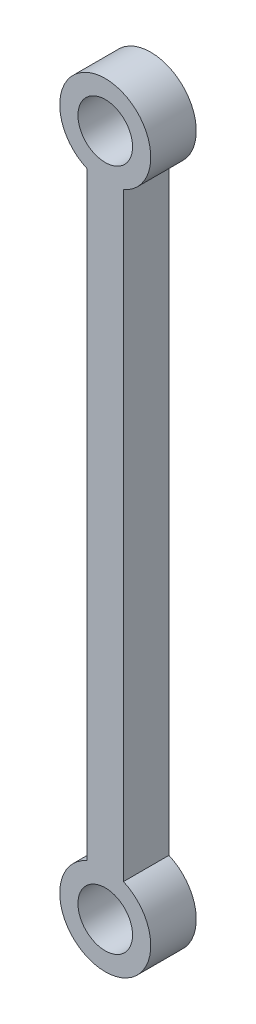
ISO-10303-21;
HEADER;
FILE_DESCRIPTION(('STEP AP214'),'2;1');
FILE_NAME('part.step','',(''),(''),'','','');
FILE_SCHEMA(('AUTOMOTIVE_DESIGN { 1 0 10303 214 1 1 1 1 }'));
ENDSEC;
DATA;
#1=APPLICATION_CONTEXT('core data for automotive mechanical design processes');
#2=APPLICATION_PROTOCOL_DEFINITION('international standard','automotive_design',2000,#1);
#3=PRODUCT_CONTEXT('',#1,'mechanical');
#4=PRODUCT('Part','Part','',(#3));
#5=PRODUCT_RELATED_PRODUCT_CATEGORY('part','',(#4));
#6=PRODUCT_DEFINITION_FORMATION('','',#4);
#7=PRODUCT_DEFINITION_CONTEXT('part definition',#1,'design');
#8=PRODUCT_DEFINITION('design','',#6,#7);
#9=PRODUCT_DEFINITION_SHAPE('','',#8);
#10=(LENGTH_UNIT() NAMED_UNIT(*) SI_UNIT(.MILLI.,.METRE.));
#11=(NAMED_UNIT(*) PLANE_ANGLE_UNIT() SI_UNIT($,.RADIAN.));
#12=(NAMED_UNIT(*) SI_UNIT($,.STERADIAN.) SOLID_ANGLE_UNIT());
#13=UNCERTAINTY_MEASURE_WITH_UNIT(LENGTH_MEASURE(1.E-05),#10,'distance_accuracy_value','');
#14=(GEOMETRIC_REPRESENTATION_CONTEXT(3) GLOBAL_UNCERTAINTY_ASSIGNED_CONTEXT((#13)) GLOBAL_UNIT_ASSIGNED_CONTEXT((#10,
#11,#12)) REPRESENTATION_CONTEXT('',''));
#15=CARTESIAN_POINT('',(0.,0.,0.));
#16=DIRECTION('',(0.,0.,1.));
#17=DIRECTION('',(1.,0.,0.));
#18=AXIS2_PLACEMENT_3D('',#15,#16,#17);
#19=CARTESIAN_POINT('',(0.,-75.,5.));
#20=DIRECTION('',(0.,0.,1.));
#21=DIRECTION('',(1.,0.,0.));
#22=AXIS2_PLACEMENT_3D('',#19,#20,#21);
#23=PLANE('',#22);
#24=CARTESIAN_POINT('',(0.,0.,5.));
#25=DIRECTION('',(0.,0.,1.));
#26=DIRECTION('',(1.,0.,0.));
#27=AXIS2_PLACEMENT_3D('',#24,#25,#26);
#28=CIRCLE('',#27,3.);
#29=CARTESIAN_POINT('',(3.,0.,5.));
#30=VERTEX_POINT('',#29);
#31=EDGE_CURVE('E99',#30,#30,#28,.T.);
#32=ORIENTED_EDGE('',*,*,#31,.F.);
#33=EDGE_LOOP('',(#32));
#34=FACE_BOUND('',#33,.T.);
#35=CARTESIAN_POINT('',(0.,-75.,5.));
#36=DIRECTION('',(0.,0.,1.));
#37=DIRECTION('',(1.,0.,0.));
#38=AXIS2_PLACEMENT_3D('',#35,#36,#37);
#39=CIRCLE('',#38,5.);
#40=CARTESIAN_POINT('',(-1.99999999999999,-70.4174243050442,5.));
#41=VERTEX_POINT('',#40);
#42=CARTESIAN_POINT('',(2.00000000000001,-70.4174243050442,5.));
#43=VERTEX_POINT('',#42);
#44=EDGE_CURVE('E84',#41,#43,#39,.T.);
#45=ORIENTED_EDGE('',*,*,#44,.T.);
#46=DIRECTION('',(0.,1.,0.));
#47=VECTOR('',#46,1.);
#48=CARTESIAN_POINT('',(2.,-4.58257569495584,5.));
#49=LINE('',#48,#47);
#50=CARTESIAN_POINT('',(2.,-4.58257569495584,5.));
#51=VERTEX_POINT('',#50);
#52=EDGE_CURVE('E79',#43,#51,#49,.T.);
#53=ORIENTED_EDGE('',*,*,#52,.T.);
#54=CARTESIAN_POINT('',(0.,0.,5.));
#55=DIRECTION('',(0.,0.,1.));
#56=DIRECTION('',(1.,0.,0.));
#57=AXIS2_PLACEMENT_3D('',#54,#55,#56);
#58=CIRCLE('',#57,5.);
#59=CARTESIAN_POINT('',(-2.,-4.58257569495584,5.));
#60=VERTEX_POINT('',#59);
#61=EDGE_CURVE('E82',#51,#60,#58,.T.);
#62=ORIENTED_EDGE('',*,*,#61,.T.);
#63=DIRECTION('',(0.,-1.,0.));
#64=VECTOR('',#63,1.);
#65=CARTESIAN_POINT('',(-2.,-4.58257569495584,5.));
#66=LINE('',#65,#64);
#67=EDGE_CURVE('E49',#60,#41,#66,.T.);
#68=ORIENTED_EDGE('',*,*,#67,.T.);
#69=EDGE_LOOP('',(#45,#53,#62,#68));
#70=FACE_BOUND('',#69,.T.);
#71=CARTESIAN_POINT('',(0.,-75.,5.));
#72=DIRECTION('',(0.,0.,1.));
#73=DIRECTION('',(1.,0.,0.));
#74=AXIS2_PLACEMENT_3D('',#71,#72,#73);
#75=CIRCLE('',#74,3.);
#76=CARTESIAN_POINT('',(3.00000000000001,-75.,5.));
#77=VERTEX_POINT('',#76);
#78=EDGE_CURVE('E114',#77,#77,#75,.T.);
#79=ORIENTED_EDGE('',*,*,#78,.F.);
#80=EDGE_LOOP('',(#79));
#81=FACE_BOUND('',#80,.T.);
#82=ADVANCED_FACE('F32',(#34,#70,#81),#23,.T.);
#83=CARTESIAN_POINT('',(0.,-75.,0.));
#84=DIRECTION('',(0.,0.,1.));
#85=DIRECTION('',(1.,0.,0.));
#86=AXIS2_PLACEMENT_3D('',#83,#84,#85);
#87=PLANE('',#86);
#88=CARTESIAN_POINT('',(0.,0.,0.));
#89=DIRECTION('',(0.,0.,1.));
#90=DIRECTION('',(1.,0.,0.));
#91=AXIS2_PLACEMENT_3D('',#88,#89,#90);
#92=CIRCLE('',#91,3.);
#93=CARTESIAN_POINT('',(3.,0.,0.));
#94=VERTEX_POINT('',#93);
#95=EDGE_CURVE('E111',#94,#94,#92,.T.);
#96=ORIENTED_EDGE('',*,*,#95,.T.);
#97=EDGE_LOOP('',(#96));
#98=FACE_BOUND('',#97,.T.);
#99=CARTESIAN_POINT('',(0.,-75.,0.));
#100=DIRECTION('',(0.,0.,1.));
#101=DIRECTION('',(1.,0.,0.));
#102=AXIS2_PLACEMENT_3D('',#99,#100,#101);
#103=CIRCLE('',#102,5.);
#104=CARTESIAN_POINT('',(-1.99999999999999,-70.4174243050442,0.));
#105=VERTEX_POINT('',#104);
#106=CARTESIAN_POINT('',(2.00000000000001,-70.4174243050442,0.));
#107=VERTEX_POINT('',#106);
#108=EDGE_CURVE('E96',#105,#107,#103,.T.);
#109=ORIENTED_EDGE('',*,*,#108,.F.);
#110=DIRECTION('',(0.,-1.,0.));
#111=VECTOR('',#110,1.);
#112=CARTESIAN_POINT('',(-2.,-4.58257569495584,0.));
#113=LINE('',#112,#111);
#114=CARTESIAN_POINT('',(-2.,-4.58257569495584,0.));
#115=VERTEX_POINT('',#114);
#116=EDGE_CURVE('E72',#115,#105,#113,.T.);
#117=ORIENTED_EDGE('',*,*,#116,.F.);
#118=CARTESIAN_POINT('',(0.,0.,0.));
#119=DIRECTION('',(0.,0.,1.));
#120=DIRECTION('',(1.,0.,0.));
#121=AXIS2_PLACEMENT_3D('',#118,#119,#120);
#122=CIRCLE('',#121,5.);
#123=CARTESIAN_POINT('',(2.,-4.58257569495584,0.));
#124=VERTEX_POINT('',#123);
#125=EDGE_CURVE('E66',#124,#115,#122,.T.);
#126=ORIENTED_EDGE('',*,*,#125,.F.);
#127=DIRECTION('',(0.,1.,0.));
#128=VECTOR('',#127,1.);
#129=CARTESIAN_POINT('',(2.,-4.58257569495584,0.));
#130=LINE('',#129,#128);
#131=EDGE_CURVE('E88',#107,#124,#130,.T.);
#132=ORIENTED_EDGE('',*,*,#131,.F.);
#133=EDGE_LOOP('',(#109,#117,#126,#132));
#134=FACE_BOUND('',#133,.T.);
#135=CARTESIAN_POINT('',(0.,-75.,0.));
#136=DIRECTION('',(0.,0.,1.));
#137=DIRECTION('',(1.,0.,0.));
#138=AXIS2_PLACEMENT_3D('',#135,#136,#137);
#139=CIRCLE('',#138,3.);
#140=CARTESIAN_POINT('',(3.00000000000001,-75.,0.));
#141=VERTEX_POINT('',#140);
#142=EDGE_CURVE('E117',#141,#141,#139,.T.);
#143=ORIENTED_EDGE('',*,*,#142,.T.);
#144=EDGE_LOOP('',(#143));
#145=FACE_BOUND('',#144,.T.);
#146=ADVANCED_FACE('F107',(#98,#134,#145),#87,.F.);
#147=CARTESIAN_POINT('',(0.,-75.,5.));
#148=DIRECTION('',(0.,0.,-1.));
#149=DIRECTION('',(-1.,0.,0.));
#150=AXIS2_PLACEMENT_3D('',#147,#148,#149);
#151=CYLINDRICAL_SURFACE('',#150,5.);
#152=ORIENTED_EDGE('',*,*,#108,.T.);
#153=DIRECTION('',(0.,0.,-1.));
#154=VECTOR('',#153,1.);
#155=CARTESIAN_POINT('',(2.00000000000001,-70.4174243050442,5.));
#156=LINE('',#155,#154);
#157=EDGE_CURVE('E11',#43,#107,#156,.T.);
#158=ORIENTED_EDGE('',*,*,#157,.F.);
#159=ORIENTED_EDGE('',*,*,#44,.F.);
#160=DIRECTION('',(0.,0.,-1.));
#161=VECTOR('',#160,1.);
#162=CARTESIAN_POINT('',(-1.99999999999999,-70.4174243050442,5.));
#163=LINE('',#162,#161);
#164=EDGE_CURVE('E92',#41,#105,#163,.T.);
#165=ORIENTED_EDGE('',*,*,#164,.T.);
#166=EDGE_LOOP('',(#152,#158,#159,#165));
#167=FACE_BOUND('',#166,.T.);
#168=ADVANCED_FACE('F34',(#167),#151,.T.);
#169=CARTESIAN_POINT('',(2.,-4.58257569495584,5.));
#170=DIRECTION('',(-1.,0.,0.));
#171=DIRECTION('',(0.,-1.,0.));
#172=AXIS2_PLACEMENT_3D('',#169,#170,#171);
#173=PLANE('',#172);
#174=ORIENTED_EDGE('',*,*,#131,.T.);
#175=DIRECTION('',(0.,0.,-1.));
#176=VECTOR('',#175,1.);
#177=CARTESIAN_POINT('',(2.,-4.58257569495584,5.));
#178=LINE('',#177,#176);
#179=EDGE_CURVE('E41',#51,#124,#178,.T.);
#180=ORIENTED_EDGE('',*,*,#179,.F.);
#181=ORIENTED_EDGE('',*,*,#52,.F.);
#182=ORIENTED_EDGE('',*,*,#157,.T.);
#183=EDGE_LOOP('',(#174,#180,#181,#182));
#184=FACE_BOUND('',#183,.T.);
#185=ADVANCED_FACE('F87',(#184),#173,.F.);
#186=CARTESIAN_POINT('',(0.,0.,5.));
#187=DIRECTION('',(0.,0.,-1.));
#188=DIRECTION('',(-1.,0.,0.));
#189=AXIS2_PLACEMENT_3D('',#186,#187,#188);
#190=CYLINDRICAL_SURFACE('',#189,5.);
#191=ORIENTED_EDGE('',*,*,#125,.T.);
#192=DIRECTION('',(0.,0.,-1.));
#193=VECTOR('',#192,1.);
#194=CARTESIAN_POINT('',(-2.,-4.58257569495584,5.));
#195=LINE('',#194,#193);
#196=EDGE_CURVE('E89',#60,#115,#195,.T.);
#197=ORIENTED_EDGE('',*,*,#196,.F.);
#198=ORIENTED_EDGE('',*,*,#61,.F.);
#199=ORIENTED_EDGE('',*,*,#179,.T.);
#200=EDGE_LOOP('',(#191,#197,#198,#199));
#201=FACE_BOUND('',#200,.T.);
#202=ADVANCED_FACE('F90',(#201),#190,.T.);
#203=CARTESIAN_POINT('',(-2.,-4.58257569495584,5.));
#204=DIRECTION('',(1.,0.,0.));
#205=DIRECTION('',(0.,1.,0.));
#206=AXIS2_PLACEMENT_3D('',#203,#204,#205);
#207=PLANE('',#206);
#208=ORIENTED_EDGE('',*,*,#116,.T.);
#209=ORIENTED_EDGE('',*,*,#164,.F.);
#210=ORIENTED_EDGE('',*,*,#67,.F.);
#211=ORIENTED_EDGE('',*,*,#196,.T.);
#212=EDGE_LOOP('',(#208,#209,#210,#211));
#213=FACE_BOUND('',#212,.T.);
#214=ADVANCED_FACE('F104',(#213),#207,.F.);
#215=CARTESIAN_POINT('',(0.,0.,5.));
#216=DIRECTION('',(0.,0.,-1.));
#217=DIRECTION('',(-1.,0.,0.));
#218=AXIS2_PLACEMENT_3D('',#215,#216,#217);
#219=CYLINDRICAL_SURFACE('',#218,3.);
#220=ORIENTED_EDGE('',*,*,#31,.T.);
#221=EDGE_LOOP('',(#220));
#222=FACE_BOUND('',#221,.T.);
#223=ORIENTED_EDGE('',*,*,#95,.F.);
#224=EDGE_LOOP('',(#223));
#225=FACE_BOUND('',#224,.T.);
#226=ADVANCED_FACE('F135',(#222,#225),#219,.F.);
#227=CARTESIAN_POINT('',(0.,-75.,5.));
#228=DIRECTION('',(0.,0.,-1.));
#229=DIRECTION('',(-1.,0.,0.));
#230=AXIS2_PLACEMENT_3D('',#227,#228,#229);
#231=CYLINDRICAL_SURFACE('',#230,3.);
#232=ORIENTED_EDGE('',*,*,#78,.T.);
#233=EDGE_LOOP('',(#232));
#234=FACE_BOUND('',#233,.T.);
#235=ORIENTED_EDGE('',*,*,#142,.F.);
#236=EDGE_LOOP('',(#235));
#237=FACE_BOUND('',#236,.T.);
#238=ADVANCED_FACE('F123',(#234,#237),#231,.F.);
#239=CLOSED_SHELL('',(#82,#146,#168,#185,#202,#214,#226,#238));
#240=MANIFOLD_SOLID_BREP('B2',#239);
#241=ADVANCED_BREP_SHAPE_REPRESENTATION('',(#18,#240),#14);
#242=SHAPE_DEFINITION_REPRESENTATION(#9,#241);
ENDSEC;
END-ISO-10303-21;
